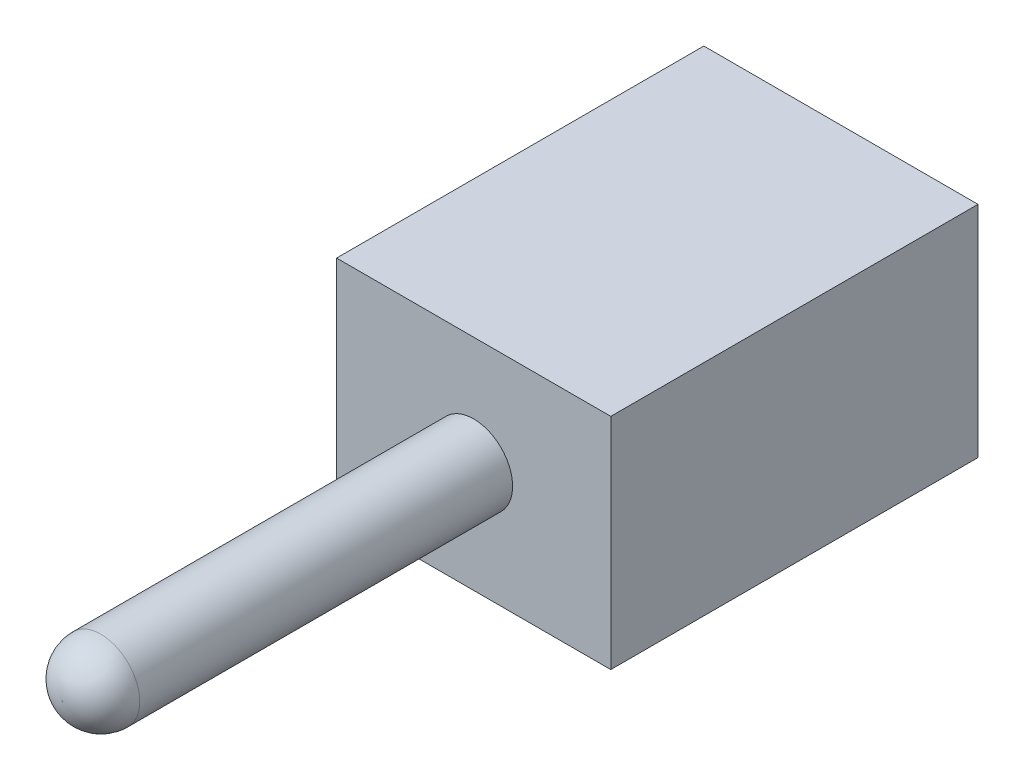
ISO-10303-21;
HEADER;
FILE_DESCRIPTION(('STEP AP214'),'2;1');
FILE_NAME('part.step','',(''),(''),'','','');
FILE_SCHEMA(('AUTOMOTIVE_DESIGN { 1 0 10303 214 1 1 1 1 }'));
ENDSEC;
DATA;
#1=APPLICATION_CONTEXT('core data for automotive mechanical design processes');
#2=APPLICATION_PROTOCOL_DEFINITION('international standard','automotive_design',2000,#1);
#3=PRODUCT_CONTEXT('',#1,'mechanical');
#4=PRODUCT('Part','Part','',(#3));
#5=PRODUCT_RELATED_PRODUCT_CATEGORY('part','',(#4));
#6=PRODUCT_DEFINITION_FORMATION('','',#4);
#7=PRODUCT_DEFINITION_CONTEXT('part definition',#1,'design');
#8=PRODUCT_DEFINITION('design','',#6,#7);
#9=PRODUCT_DEFINITION_SHAPE('','',#8);
#10=(LENGTH_UNIT() NAMED_UNIT(*) SI_UNIT(.MILLI.,.METRE.));
#11=(NAMED_UNIT(*) PLANE_ANGLE_UNIT() SI_UNIT($,.RADIAN.));
#12=(NAMED_UNIT(*) SI_UNIT($,.STERADIAN.) SOLID_ANGLE_UNIT());
#13=UNCERTAINTY_MEASURE_WITH_UNIT(LENGTH_MEASURE(1.E-05),#10,'distance_accuracy_value','');
#14=(GEOMETRIC_REPRESENTATION_CONTEXT(3) GLOBAL_UNCERTAINTY_ASSIGNED_CONTEXT((#13)) GLOBAL_UNIT_ASSIGNED_CONTEXT((#10,
#11,#12)) REPRESENTATION_CONTEXT('',''));
#15=CARTESIAN_POINT('',(0.,0.,0.));
#16=DIRECTION('',(0.,0.,1.));
#17=DIRECTION('',(1.,0.,0.));
#18=AXIS2_PLACEMENT_3D('',#15,#16,#17);
#19=CARTESIAN_POINT('',(-6.35,10.16,17.01));
#20=DIRECTION('',(0.,0.,-1.));
#21=DIRECTION('',(-1.,0.,0.));
#22=AXIS2_PLACEMENT_3D('',#19,#20,#21);
#23=PLANE('',#22);
#24=DIRECTION('',(1.,0.,0.));
#25=VECTOR('',#24,1.);
#26=CARTESIAN_POINT('',(-6.35,0.,17.01));
#27=LINE('',#26,#25);
#28=CARTESIAN_POINT('',(-6.35,0.,17.01));
#29=VERTEX_POINT('',#28);
#30=CARTESIAN_POINT('',(6.35,0.,17.01));
#31=VERTEX_POINT('',#30);
#32=EDGE_CURVE('E75',#29,#31,#27,.T.);
#33=ORIENTED_EDGE('',*,*,#32,.T.);
#34=DIRECTION('',(0.,-1.,0.));
#35=VECTOR('',#34,1.);
#36=CARTESIAN_POINT('',(6.35,10.16,17.01));
#37=LINE('',#36,#35);
#38=CARTESIAN_POINT('',(6.35,10.16,17.01));
#39=VERTEX_POINT('',#38);
#40=EDGE_CURVE('E93',#39,#31,#37,.T.);
#41=ORIENTED_EDGE('',*,*,#40,.F.);
#42=DIRECTION('',(1.,0.,0.));
#43=VECTOR('',#42,1.);
#44=CARTESIAN_POINT('',(-6.35,10.16,17.01));
#45=LINE('',#44,#43);
#46=CARTESIAN_POINT('',(-6.35,10.16,17.01));
#47=VERTEX_POINT('',#46);
#48=EDGE_CURVE('E89',#47,#39,#45,.T.);
#49=ORIENTED_EDGE('',*,*,#48,.F.);
#50=DIRECTION('',(0.,-1.,0.));
#51=VECTOR('',#50,1.);
#52=CARTESIAN_POINT('',(-6.35,10.16,17.01));
#53=LINE('',#52,#51);
#54=EDGE_CURVE('E87',#47,#29,#53,.T.);
#55=ORIENTED_EDGE('',*,*,#54,.T.);
#56=EDGE_LOOP('',(#33,#41,#49,#55));
#57=FACE_BOUND('',#56,.T.);
#58=CARTESIAN_POINT('',(0.,5.08,17.01));
#59=DIRECTION('',(0.,0.,-1.));
#60=DIRECTION('',(-1.,0.,0.));
#61=AXIS2_PLACEMENT_3D('',#58,#59,#60);
#62=CIRCLE('',#61,1.8034);
#63=CARTESIAN_POINT('',(-1.8034,5.08,17.01));
#64=VERTEX_POINT('',#63);
#65=EDGE_CURVE('E92',#64,#64,#62,.F.);
#66=ORIENTED_EDGE('',*,*,#65,.F.);
#67=EDGE_LOOP('',(#66));
#68=FACE_BOUND('',#67,.T.);
#69=ADVANCED_FACE('F34',(#57,#68),#23,.F.);
#70=CARTESIAN_POINT('',(-6.35,0.,17.01));
#71=DIRECTION('',(0.,1.,0.));
#72=DIRECTION('',(0.,0.,1.));
#73=AXIS2_PLACEMENT_3D('',#70,#71,#72);
#74=PLANE('',#73);
#75=DIRECTION('',(0.,0.,1.));
#76=VECTOR('',#75,1.);
#77=CARTESIAN_POINT('',(-6.35,0.,0.));
#78=LINE('',#77,#76);
#79=CARTESIAN_POINT('',(-6.35,0.,0.));
#80=VERTEX_POINT('',#79);
#81=EDGE_CURVE('E80',#80,#29,#78,.T.);
#82=ORIENTED_EDGE('',*,*,#81,.F.);
#83=DIRECTION('',(-1.,0.,0.));
#84=VECTOR('',#83,1.);
#85=CARTESIAN_POINT('',(-6.35,0.,0.));
#86=LINE('',#85,#84);
#87=CARTESIAN_POINT('',(6.35,0.,0.));
#88=VERTEX_POINT('',#87);
#89=EDGE_CURVE('E100',#88,#80,#86,.T.);
#90=ORIENTED_EDGE('',*,*,#89,.F.);
#91=DIRECTION('',(0.,0.,-1.));
#92=VECTOR('',#91,1.);
#93=CARTESIAN_POINT('',(6.35,0.,0.));
#94=LINE('',#93,#92);
#95=EDGE_CURVE('E81',#31,#88,#94,.T.);
#96=ORIENTED_EDGE('',*,*,#95,.F.);
#97=ORIENTED_EDGE('',*,*,#32,.F.);
#98=EDGE_LOOP('',(#82,#90,#96,#97));
#99=FACE_BOUND('',#98,.T.);
#100=ADVANCED_FACE('F77',(#99),#74,.F.);
#101=CARTESIAN_POINT('',(-6.35,10.16,0.));
#102=DIRECTION('',(1.,0.,0.));
#103=DIRECTION('',(0.,0.,-1.));
#104=AXIS2_PLACEMENT_3D('',#101,#102,#103);
#105=PLANE('',#104);
#106=ORIENTED_EDGE('',*,*,#81,.T.);
#107=ORIENTED_EDGE('',*,*,#54,.F.);
#108=DIRECTION('',(0.,0.,1.));
#109=VECTOR('',#108,1.);
#110=CARTESIAN_POINT('',(-6.35,10.16,0.));
#111=LINE('',#110,#109);
#112=CARTESIAN_POINT('',(-6.35,10.16,0.));
#113=VERTEX_POINT('',#112);
#114=EDGE_CURVE('E102',#113,#47,#111,.T.);
#115=ORIENTED_EDGE('',*,*,#114,.F.);
#116=DIRECTION('',(0.,-1.,0.));
#117=VECTOR('',#116,1.);
#118=CARTESIAN_POINT('',(-6.35,10.16,0.));
#119=LINE('',#118,#117);
#120=EDGE_CURVE('E96',#113,#80,#119,.T.);
#121=ORIENTED_EDGE('',*,*,#120,.T.);
#122=EDGE_LOOP('',(#106,#107,#115,#121));
#123=FACE_BOUND('',#122,.T.);
#124=ADVANCED_FACE('F36',(#123),#105,.F.);
#125=CARTESIAN_POINT('',(6.35,10.16,0.));
#126=DIRECTION('',(-1.,0.,0.));
#127=DIRECTION('',(0.,0.,1.));
#128=AXIS2_PLACEMENT_3D('',#125,#126,#127);
#129=PLANE('',#128);
#130=ORIENTED_EDGE('',*,*,#95,.T.);
#131=DIRECTION('',(0.,-1.,0.));
#132=VECTOR('',#131,1.);
#133=CARTESIAN_POINT('',(6.35,10.16,0.));
#134=LINE('',#133,#132);
#135=CARTESIAN_POINT('',(6.35,10.16,0.));
#136=VERTEX_POINT('',#135);
#137=EDGE_CURVE('E108',#136,#88,#134,.T.);
#138=ORIENTED_EDGE('',*,*,#137,.F.);
#139=DIRECTION('',(0.,0.,-1.));
#140=VECTOR('',#139,1.);
#141=CARTESIAN_POINT('',(6.35,10.16,0.));
#142=LINE('',#141,#140);
#143=EDGE_CURVE('E54',#39,#136,#142,.T.);
#144=ORIENTED_EDGE('',*,*,#143,.F.);
#145=ORIENTED_EDGE('',*,*,#40,.T.);
#146=EDGE_LOOP('',(#130,#138,#144,#145));
#147=FACE_BOUND('',#146,.T.);
#148=ADVANCED_FACE('F134',(#147),#129,.F.);
#149=CARTESIAN_POINT('',(-6.35,10.16,0.));
#150=DIRECTION('',(0.,0.,1.));
#151=DIRECTION('',(1.,0.,0.));
#152=AXIS2_PLACEMENT_3D('',#149,#150,#151);
#153=PLANE('',#152);
#154=ORIENTED_EDGE('',*,*,#89,.T.);
#155=ORIENTED_EDGE('',*,*,#120,.F.);
#156=DIRECTION('',(-1.,0.,0.));
#157=VECTOR('',#156,1.);
#158=CARTESIAN_POINT('',(-6.35,10.16,0.));
#159=LINE('',#158,#157);
#160=EDGE_CURVE('E49',#136,#113,#159,.T.);
#161=ORIENTED_EDGE('',*,*,#160,.F.);
#162=ORIENTED_EDGE('',*,*,#137,.T.);
#163=EDGE_LOOP('',(#154,#155,#161,#162));
#164=FACE_BOUND('',#163,.T.);
#165=ADVANCED_FACE('F137',(#164),#153,.F.);
#166=CARTESIAN_POINT('',(-6.35,10.16,17.01));
#167=DIRECTION('',(0.,1.,0.));
#168=DIRECTION('',(0.,0.,1.));
#169=AXIS2_PLACEMENT_3D('',#166,#167,#168);
#170=PLANE('',#169);
#171=ORIENTED_EDGE('',*,*,#114,.T.);
#172=ORIENTED_EDGE('',*,*,#48,.T.);
#173=ORIENTED_EDGE('',*,*,#143,.T.);
#174=ORIENTED_EDGE('',*,*,#160,.T.);
#175=EDGE_LOOP('',(#171,#172,#173,#174));
#176=FACE_BOUND('',#175,.T.);
#177=ADVANCED_FACE('F141',(#176),#170,.T.);
#178=CARTESIAN_POINT('',(0.,5.08,36.06));
#179=DIRECTION('',(0.,0.,-1.));
#180=DIRECTION('',(-1.,0.,0.));
#181=AXIS2_PLACEMENT_3D('',#178,#179,#180);
#182=CYLINDRICAL_SURFACE('',#181,1.8034);
#183=CARTESIAN_POINT('',(0.,5.08,34.282));
#184=DIRECTION('',(0.,0.,1.));
#185=DIRECTION('',(1.,0.,0.));
#186=AXIS2_PLACEMENT_3D('',#183,#184,#185);
#187=CIRCLE('',#186,1.8034);
#188=CARTESIAN_POINT('',(1.8034,5.08,34.282));
#189=VERTEX_POINT('',#188);
#190=EDGE_CURVE('E11',#189,#189,#187,.F.);
#191=ORIENTED_EDGE('',*,*,#190,.T.);
#192=EDGE_LOOP('',(#191));
#193=FACE_BOUND('',#192,.T.);
#194=ORIENTED_EDGE('',*,*,#65,.T.);
#195=EDGE_LOOP('',(#194));
#196=FACE_BOUND('',#195,.T.);
#197=ADVANCED_FACE('F125',(#193,#196),#182,.T.);
#198=CARTESIAN_POINT('',(0.,5.08,36.06));
#199=DIRECTION('',(0.,0.,1.));
#200=DIRECTION('',(1.,0.,0.));
#201=AXIS2_PLACEMENT_3D('',#198,#199,#200);
#202=PLANE('',#201);
#203=CARTESIAN_POINT('',(0.,5.08,36.06));
#204=DIRECTION('',(0.,0.,1.));
#205=DIRECTION('',(1.,0.,0.));
#206=AXIS2_PLACEMENT_3D('',#203,#204,#205);
#207=CIRCLE('',#206,0.0253999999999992);
#208=CARTESIAN_POINT('',(0.0253999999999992,5.08,36.06));
#209=VERTEX_POINT('',#208);
#210=EDGE_CURVE('E42',#209,#209,#207,.T.);
#211=ORIENTED_EDGE('',*,*,#210,.T.);
#212=EDGE_LOOP('',(#211));
#213=FACE_BOUND('',#212,.T.);
#214=ADVANCED_FACE('F116',(#213),#202,.T.);
#215=CARTESIAN_POINT('',(0.,5.08,34.282));
#216=DIRECTION('',(0.,0.,1.));
#217=DIRECTION('',(1.,0.,0.));
#218=AXIS2_PLACEMENT_3D('',#215,#216,#217);
#219=DEGENERATE_TOROIDAL_SURFACE('',#218,0.0253999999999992,1.778,.T.);
#220=ORIENTED_EDGE('',*,*,#190,.F.);
#221=EDGE_LOOP('',(#220));
#222=FACE_BOUND('',#221,.T.);
#223=ORIENTED_EDGE('',*,*,#210,.F.);
#224=EDGE_LOOP('',(#223));
#225=FACE_BOUND('',#224,.T.);
#226=ADVANCED_FACE('F118',(#222,#225),#219,.T.);
#227=CLOSED_SHELL('',(#69,#100,#124,#148,#165,#177,#197,#214,#226));
#228=MANIFOLD_SOLID_BREP('B2',#227);
#229=ADVANCED_BREP_SHAPE_REPRESENTATION('',(#18,#228),#14);
#230=SHAPE_DEFINITION_REPRESENTATION(#9,#229);
ENDSEC;
END-ISO-10303-21;
